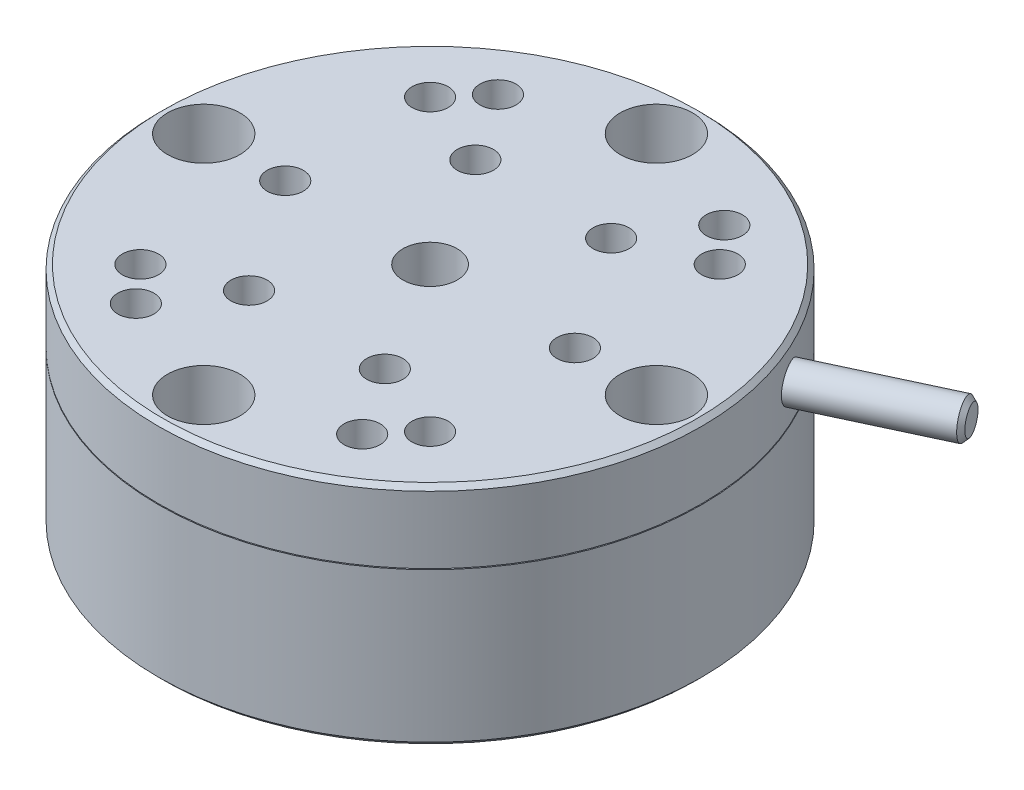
from build123d import *

# Parameters (mm, degrees)
HOLE_WIZARD_M4_2_D           = 4.5
HOLE_WIZARD_M4_2_CBORE_D     = 8
HOLE_WIZARD_M4_2_CBORE_DEPTH = 21
HOLE_WIZARD_4_0_4_1_D        = 4
HOLE_WIZARD_4_0_4_1_DEPTH    = 5
HOLE_WIZARD_4_0_4_1_TIP      = 1.201721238
HOLE_WIZARD_4_0_4_2_D        = 4
HOLE_WIZARD_4_0_4_2_DEPTH    = 5
HOLE_WIZARD_4_0_4_2_TIP      = 1.201721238
HOLE_WIZARD_6_0_6_1_D        = 6
HOLE_WIZARD_6_0_6_1_DEPTH    = 14
HOLE_WIZARD_6_0_6_1_TIP      = 1.802581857


with BuildPart() as part:
    # Sketch 1 → Revolve 1 (revolve)
    with BuildSketch(Plane.XY, mode=Mode.PRIVATE) as revolve_1_sk:
        Polygon((0, 25), (0, 0), (-29.5, 0), (-30, 0.5), (-30, 17), (-29.5, 17), (-29.5, 17.1), (-30, 17.1), (-30, 24.5), (-29.5, 25), align=None)
    revolve(revolve_1_sk.sketch.rotate(Axis((0, -48.218385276, 0), (0, 1, 0)), 270), axis=Axis((0, -48.218385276, 0), (0, 1, 0)))

    # Hole Wizard M4 _2 (through all)
    with Locations(Plane(origin=(0, 25, 0), x_dir=(-1, 0, 0), z_dir=(0, 1, 0))):
        with Locations((0, -25), (0, 25), (25, 0), (-25, 0)):
            CounterBoreHole(HOLE_WIZARD_M4_2_D / 2, HOLE_WIZARD_M4_2_CBORE_D / 2, HOLE_WIZARD_M4_2_CBORE_DEPTH)

    # Sketch 7 → Revolve 2 (revolve)
    with BuildSketch(Plane(origin=(0, 0, 0), x_dir=(-0.7071067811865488, 0, -0.7071067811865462), z_dir=(0.7071067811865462, 0, -0.7071067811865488)), mode=Mode.PRIVATE) as revolve_2_sk:
        Polygon((33, 13), (32.5, 12.5), (32.5, 12), (31.5, 12), (31.5, 11.5), (0, 11.5), (0, 10), (38.5, 10), (38.5, 12.5), (38, 13), align=None)
    revolve(revolve_2_sk.sketch.rotate(Axis((-22.098275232, 10, -22.098275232), (0.7071067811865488, 0, 0.7071067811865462)), 90), axis=Axis((-22.098275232, 10, -22.098275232), (0.7071067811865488, 0, 0.7071067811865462)))

    # Sketch 9 → Revolve 3 (revolve)
    with BuildSketch(Plane(origin=(0, 0, 0), x_dir=(0.9063077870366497, 0, -0.4226182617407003), z_dir=(0.4226182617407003, 0, 0.9063077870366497)), mode=Mode.PRIVATE) as revolve_3_sk:
        Polygon((0, 21), (45, 21), (45, 19.5), (44.5, 19), (0, 19), align=None)
    revolve(revolve_3_sk.sketch.rotate(Axis((12.039650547, 21, -5.614181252), (0.9063077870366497, 0, -0.4226182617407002)), 270), axis=Axis((12.039650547, 21, -5.614181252), (0.9063077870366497, 0, -0.4226182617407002)))

    # Hole Wizard 4.0 _4_ _1
    with Locations(Plane(origin=(0, 25, 0), x_dir=(-1, 0, 0), z_dir=(0, 1, 0))):
        with Locations((-7.5, -12.5), (7.5, -12.5), (7.5, 12.5), (-7.5, 12.5)):
            Hole(HOLE_WIZARD_4_0_4_1_D / 2, depth=HOLE_WIZARD_4_0_4_1_DEPTH)
            with Locations((0, 0, -(HOLE_WIZARD_4_0_4_1_DEPTH + HOLE_WIZARD_4_0_4_1_TIP / 2))):  # 118° drill point
                Cone(0, HOLE_WIZARD_4_0_4_1_D / 2, HOLE_WIZARD_4_0_4_1_TIP, mode=Mode.SUBTRACT)

    # Hole Wizard 4.0 _4_ _2
    with Locations(Plane(origin=(0, 25, 0), x_dir=(-1, 0, 0), z_dir=(0, 1, 0))):
        with Locations((16, 16), (-16, 16), (-16, -16), (16, -16), (-12.5, -20), (12.5, -20), (-12.5, 20), (12.5, 20), (-16, 0), (16, 0)):
            Hole(HOLE_WIZARD_4_0_4_2_D / 2, depth=HOLE_WIZARD_4_0_4_2_DEPTH)
            with Locations((0, 0, -(HOLE_WIZARD_4_0_4_2_DEPTH + HOLE_WIZARD_4_0_4_2_TIP / 2))):  # 118° drill point
                Cone(0, HOLE_WIZARD_4_0_4_2_D / 2, HOLE_WIZARD_4_0_4_2_TIP, mode=Mode.SUBTRACT)

    # Hole Wizard 6.0 _6_ _1
    with Locations(Plane(origin=(0, 25, 0), x_dir=(-1, 0, 0), z_dir=(0, 1, 0))):
        with Locations((0, 0)):
            Hole(HOLE_WIZARD_6_0_6_1_D / 2, depth=HOLE_WIZARD_6_0_6_1_DEPTH)
            with Locations((0, 0, -(HOLE_WIZARD_6_0_6_1_DEPTH + HOLE_WIZARD_6_0_6_1_TIP / 2))):  # 118° drill point
                Cone(0, HOLE_WIZARD_6_0_6_1_D / 2, HOLE_WIZARD_6_0_6_1_TIP, mode=Mode.SUBTRACT)


solid = part.part
